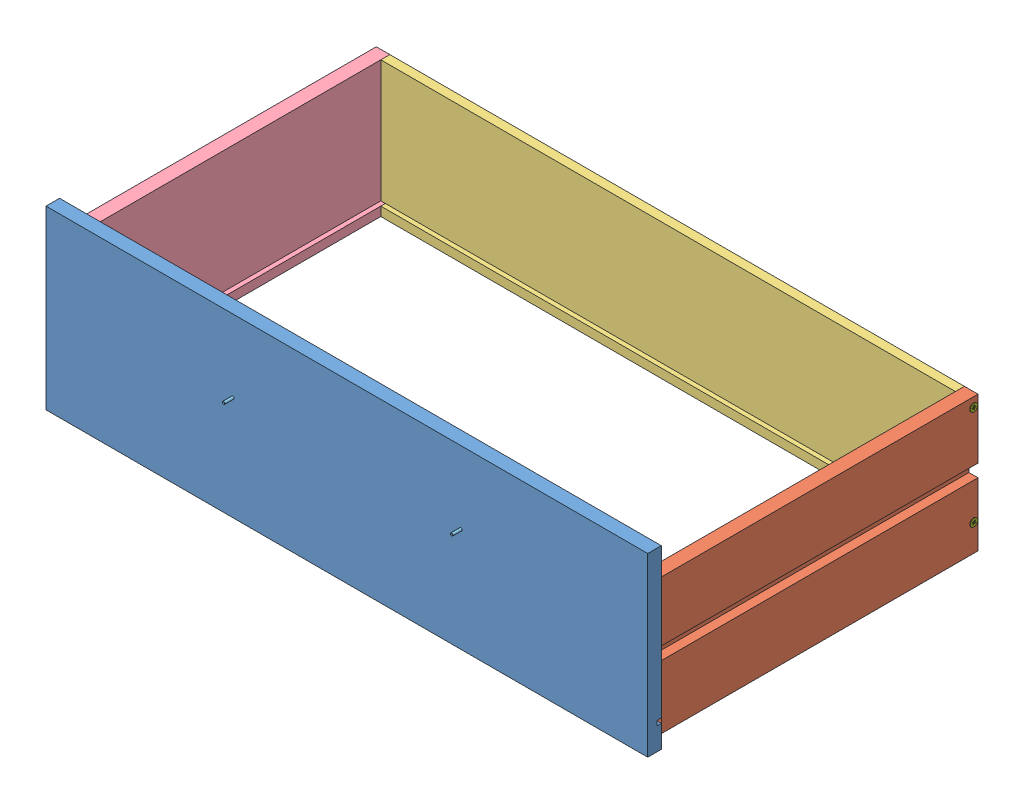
SolidWorks assembly DRAWER.SLDASM, configuration Default (file format 3100). Lengths in mm.
Overall size (666.2 195 400.72).
16 component instances, 9 part files, 28 mates.
Components (placement in the parent):
- Drawer_Front-1: Drawer_Front.SLDPRT [Default] at origin size (665 195 15)
- Drawer_Side-1: Drawer_Side.SLDPRT [Default] at (332.5 15 -15) size (15 150 350)
- Drawer_Back-1: Drawer_Back.SLDPRT [Default] at (0 85 -365) size (635 150 10)
- Drawer_SideMirror-1: Drawer_SideMirror.SLDPRT [Default] at (-332.5 15 -15) size (15 150 350)
- Drawer_Bottom-1: Drawer_Bottom.SLDPRT [Default] at (0 85 -360) size (645 5 350)
- handle-1: handle.SLDPRT [Default] at (-126 115 0) size (262 10 35)
- SOCKET BUTTON HEAD CAP SCREW_AI-1: SOCKET BUTTON HEAD CAP SCREW_AI.SLDPRT [SBHCSCREW 0.112-48x1-SP-N] at (-126 115 -16.4986) x (0 0 1) z (0.923728 0.383049 0) size (26.9 5.41 5.41)
- SOCKET BUTTON HEAD CAP SCREW_AI-2: SOCKET BUTTON HEAD CAP SCREW_AI.SLDPRT [SBHCSCREW 0.112-48x1-SP-N] at (126 115 -16.4986) x (0 0 1) z (0.923728 0.383049 0) size (26.9 5.41 5.41)
- Dowel_Pin-1: Dowel_Pin.sldprt [Dowel] at (325 135 -25.9013) x (0 0 1) z (-1 0 0) size (15 3 3)
- Dowel_Pin-2: Dowel_Pin.sldprt [Dowel] at (-325 135 -25.9013) x (0 0 1) z (-1 0 0) size (15 3 3)
- Dowel_Pin-3: Dowel_Pin.sldprt [Dowel] at (325 55 -25.9013) x (0 0 1) z (-1 0 0) size (15 3 3)
- Dowel_Pin-4: Dowel_Pin.sldprt [Dowel] at (-325 55 -25.9013) x (0 0 1) z (-1 0 0) size (15 3 3)
- Flat Head Screw_AM-3: Flat Head Screw_AM.sldprt [B18.6.7M - M4 x 0.7 x 25 Type I Cross Recessed FHMS --25N] at (-333.1 155 -360) size (25 8.4 8.4)
- Flat Head Screw_AM-4: Flat Head Screw_AM.sldprt [B18.6.7M - M4 x 0.7 x 25 Type I Cross Recessed FHMS --25N] at (-333.1 45 -360) size (25 8.4 8.4)
- Flat Head Screw_AM-6: Flat Head Screw_AM.sldprt [B18.6.7M - M4 x 0.7 x 25 Type I Cross Recessed FHMS --25N] at (333.1 45 -360) x (-1 0 0) z (0 -0.49201 -0.870589) size (25 8.4 8.4)
- Flat Head Screw_AM-7: Flat Head Screw_AM.sldprt [B18.6.7M - M4 x 0.7 x 25 Type I Cross Recessed FHMS --25N] at (333.1 155 -360) x (-1 0 0) z (0 -0.998198 -0.060005) size (25 8.4 8.4)
Mates (geometry in assembly coordinates):
- Coincident1: coincident aligned: plane of Drawer_Front-1 through (-332.5 25 -15) normal (0 1 0); plane of Drawer_Side-1 through (317.5 25 -365) normal (0 1 0)
- Coincident2: coincident anti-aligned: plane of Drawer_Front-1 through (-332.5 195 -15) normal (0 0 -1); plane of Drawer_Side-1 through (317.5 15 -15) normal (0 0 1)
- Coincident3: coincident aligned: plane of Drawer_Front-1 through (332.5 0 -15) normal (1 0 0); plane of Drawer_Side-1 through (332.5 165 -15) normal (1 0 0)
- Coincident4: coincident aligned: plane of Drawer_Side-1 through (317.5 25 -365) normal (0 1 0); plane of Drawer_Back-1 through (-317.5 25 -355) normal (0 1 0)
- Coincident5: coincident aligned: plane of Drawer_Side-1 through (317.5 15 -365) normal (0 0 -1); plane of Drawer_Back-1 through (-317.5 165 -365) normal (0 0 -1)
- Coincident6: coincident anti-aligned: plane of Drawer_Side-1 through (317.5 165 -15) normal (-1 0 0); plane of Drawer_Back-1 through (317.5 15 -355) normal (1 0 0)
- Symmetric1: symmetric aligned: plane of Drawer_Side-1 through (332.5 165 -15) normal (1 0 0); plane of Drawer_SideMirror-1 through (-332.5 165 -15) normal (-1 0 0); plane of assembly
- Coincident7: coincident aligned: plane of Drawer_Back-1 through (-317.5 25 -355) normal (0 1 0); plane of Drawer_SideMirror-1 through (-317.5 25 -365) normal (0 1 0)
- Coincident8: coincident anti-aligned: plane of Drawer_Back-1 through (-317.5 15 -355) normal (-1 0 0); plane of Drawer_SideMirror-1 through (-317.5 165 -15) normal (1 0 0)
- Coincident9: coincident aligned: plane of Drawer_Back-1 through (-317.5 165 -365) normal (0 0 -1); plane of Drawer_SideMirror-1 through (-317.5 15 -365) normal (0 0 -1)
- Inplace1: in place: plane of Drawer_Back-1 through (-317.5 25 -360) normal (0 0 1); plane of Drawer_Bottom-1; moOrthogonalPlaneRef_w of Drawer_Back-1; plane of Drawer_Bottom-1; moOrthogonalPlaneRef_w of Drawer_Back-1; plane of Drawer_Bottom-1
- Coincident10: coincident aligned: plane of Drawer_Back-1; plane of Drawer_Bottom-1
- Coincident11: coincident aligned: moOrthogonalPlaneRef_w of Drawer_Back-1; plane of Drawer_Bottom-1
- Coincident12: coincident anti-aligned: moOrthogonalPlaneRef_w of Drawer_Back-1; plane of Drawer_Bottom-1
- Coincident10: coincident aligned: circle of Drawer_Front-1 centre (126 115 0) axis (0 0 1); circle of handle-1 centre (126 115 0) axis (0 0 1)
- Concentric31: concentric anti-aligned: cylinder of Drawer_Front-1; cylinder of ?
- Coincident141: coincident anti-aligned: plane of Drawer_Front-1 through (-332.5 195 -15) normal (0 0 -1); plane of ?
- Coincident22: coincident: point of Drawer_Side-1; point of Dowel_Pin-1
- Concentric11: concentric anti-aligned: cylinder of Drawer_Side-1; cylinder of Dowel_Pin-1
- Concentric38: concentric aligned: cylinder of Drawer_Side-1; cylinder of Flat Head Screw_AM-6
- Coincident144: coincident aligned: cone of Drawer_Side-1; cone of Flat Head Screw_AM-6
- Concentric40: concentric aligned: cylinder of Drawer_Side-1; cylinder of Flat Head Screw_AM-7
- Coincident145: coincident aligned: cone of Drawer_Side-1; cone of Flat Head Screw_AM-7
- Concentric42: concentric aligned: cylinder of Drawer_SideMirror-1; cylinder of Flat Head Screw_AM-3
- Coincident146: coincident aligned: cone of Drawer_SideMirror-1; cone of Flat Head Screw_AM-3
- Concentric43: concentric aligned: cylinder of Drawer_SideMirror-1; cylinder of Flat Head Screw_AM-4
- Coincident147: coincident aligned: cone of Drawer_SideMirror-1; cone of Flat Head Screw_AM-4
- Parallel1: parallel aligned: unknown of Drawer_Front-1; unknown of handle-1
